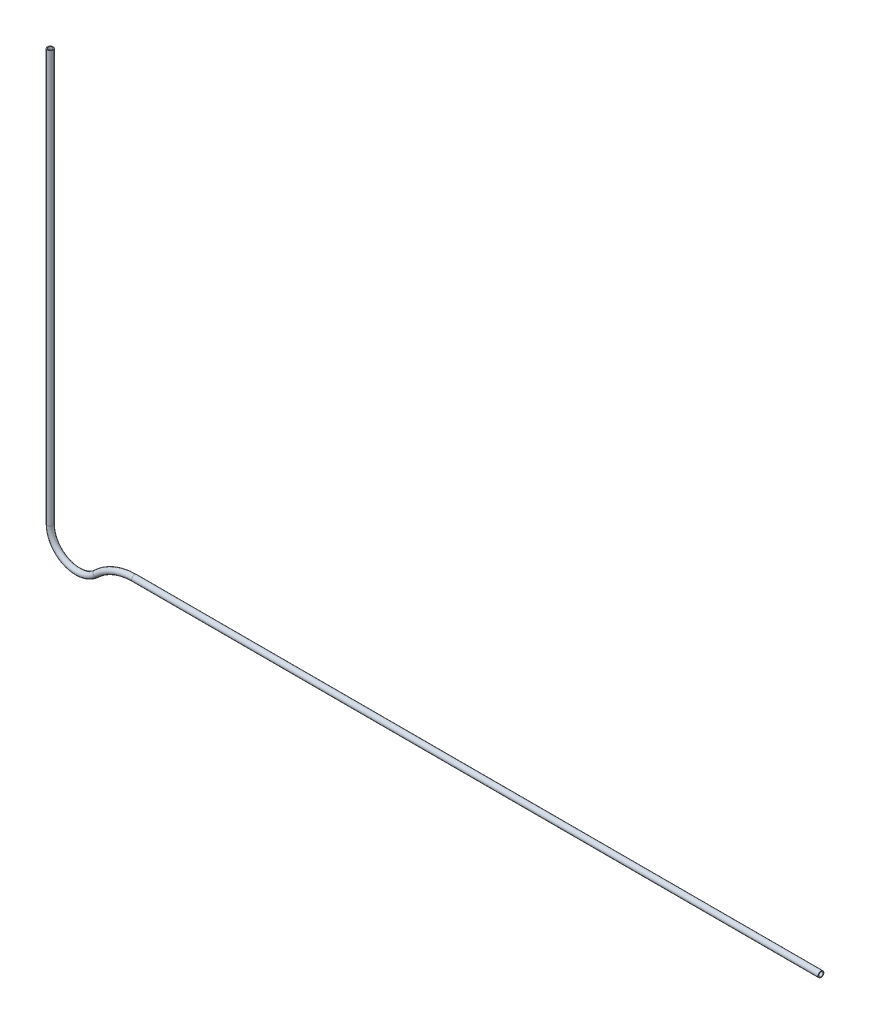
ISO-10303-21;
HEADER;
FILE_DESCRIPTION(('STEP AP214'),'2;1');
FILE_NAME('part.step','',(''),(''),'','','');
FILE_SCHEMA(('AUTOMOTIVE_DESIGN { 1 0 10303 214 1 1 1 1 }'));
ENDSEC;
DATA;
#1=APPLICATION_CONTEXT('core data for automotive mechanical design processes');
#2=APPLICATION_PROTOCOL_DEFINITION('international standard','automotive_design',2000,#1);
#3=PRODUCT_CONTEXT('',#1,'mechanical');
#4=PRODUCT('Part','Part','',(#3));
#5=PRODUCT_RELATED_PRODUCT_CATEGORY('part','',(#4));
#6=PRODUCT_DEFINITION_FORMATION('','',#4);
#7=PRODUCT_DEFINITION_CONTEXT('part definition',#1,'design');
#8=PRODUCT_DEFINITION('design','',#6,#7);
#9=PRODUCT_DEFINITION_SHAPE('','',#8);
#10=(LENGTH_UNIT() NAMED_UNIT(*) SI_UNIT(.MILLI.,.METRE.));
#11=(NAMED_UNIT(*) PLANE_ANGLE_UNIT() SI_UNIT($,.RADIAN.));
#12=(NAMED_UNIT(*) SI_UNIT($,.STERADIAN.) SOLID_ANGLE_UNIT());
#13=UNCERTAINTY_MEASURE_WITH_UNIT(LENGTH_MEASURE(1.E-05),#10,'distance_accuracy_value','');
#14=(GEOMETRIC_REPRESENTATION_CONTEXT(3) GLOBAL_UNCERTAINTY_ASSIGNED_CONTEXT((#13)) GLOBAL_UNIT_ASSIGNED_CONTEXT((#10,
#11,#12)) REPRESENTATION_CONTEXT('',''));
#15=CARTESIAN_POINT('',(0.,0.,0.));
#16=DIRECTION('',(0.,0.,1.));
#17=DIRECTION('',(1.,0.,0.));
#18=AXIS2_PLACEMENT_3D('',#15,#16,#17);
#19=CARTESIAN_POINT('',(-2806.98976363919,17.1525679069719,0.));
#20=DIRECTION('',(0.,1.,0.));
#21=DIRECTION('',(0.,0.,1.));
#22=AXIS2_PLACEMENT_3D('',#19,#20,#21);
#23=CYLINDRICAL_SURFACE('',#22,10.5);
#24=CARTESIAN_POINT('',(-2806.98976363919,17.1525679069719,0.));
#25=DIRECTION('',(0.,-1.,0.));
#26=DIRECTION('',(0.,0.,-1.));
#27=AXIS2_PLACEMENT_3D('',#24,#25,#26);
#28=CIRCLE('',#27,10.5);
#29=CARTESIAN_POINT('',(-2817.48976363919,17.1525679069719,0.));
#30=VERTEX_POINT('',#29);
#31=EDGE_CURVE('E35',#30,#30,#28,.T.);
#32=ORIENTED_EDGE('',*,*,#31,.F.);
#33=EDGE_LOOP('',(#32));
#34=FACE_BOUND('',#33,.T.);
#35=CARTESIAN_POINT('',(-2806.98976363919,1517.15256790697,0.));
#36=DIRECTION('',(0.,-1.,0.));
#37=DIRECTION('',(0.,0.,-1.));
#38=AXIS2_PLACEMENT_3D('',#35,#36,#37);
#39=CIRCLE('',#38,10.5);
#40=CARTESIAN_POINT('',(-2806.98976363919,1517.15256790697,-10.5));
#41=VERTEX_POINT('',#40);
#42=EDGE_CURVE('E10',#41,#41,#39,.T.);
#43=ORIENTED_EDGE('',*,*,#42,.T.);
#44=EDGE_LOOP('',(#43));
#45=FACE_BOUND('',#44,.T.);
#46=ADVANCED_FACE('F29',(#34,#45),#23,.T.);
#47=CARTESIAN_POINT('',(-2706.98976363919,17.1525679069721,0.));
#48=DIRECTION('',(0.,0.,-1.));
#49=DIRECTION('',(-1.,0.,0.));
#50=AXIS2_PLACEMENT_3D('',#47,#48,#49);
#51=TOROIDAL_SURFACE('',#50,100.,10.5);
#52=CARTESIAN_POINT('',(-2637.99317575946,-55.2316213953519,0.));
#53=DIRECTION('',(0.723841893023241,0.6899658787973,0.));
#54=DIRECTION('',(0.,0.,-1.));
#55=AXIS2_PLACEMENT_3D('',#52,#53,#54);
#56=CIRCLE('',#55,10.5);
#57=CARTESIAN_POINT('',(-2630.74853403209,-62.8319612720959,0.));
#58=VERTEX_POINT('',#57);
#59=EDGE_CURVE('E39',#58,#58,#56,.T.);
#60=CARTESIAN_POINT('',(-2706.98976363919,17.1525679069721,0.));
#61=DIRECTION('',(0.,0.,-1.));
#62=DIRECTION('',(-1.,0.,0.));
#63=AXIS2_PLACEMENT_3D('',#60,#61,#62);
#64=CIRCLE('',#63,110.5);
#65=EDGE_CURVE('',#58,#30,#64,.T.);
#66=ORIENTED_EDGE('',*,*,#59,.F.);
#67=ORIENTED_EDGE('',*,*,#31,.T.);
#68=ORIENTED_EDGE('',*,*,#65,.T.);
#69=ORIENTED_EDGE('',*,*,#65,.F.);
#70=EDGE_LOOP('',(#66,#68,#67,#69));
#71=FACE_BOUND('',#70,.T.);
#72=ADVANCED_FACE('F85',(#71),#51,.T.);
#73=CARTESIAN_POINT('',(-2500.,-200.,0.));
#74=DIRECTION('',(0.,0.,1.));
#75=DIRECTION('',(1.,0.,0.));
#76=AXIS2_PLACEMENT_3D('',#73,#74,#75);
#77=TOROIDAL_SURFACE('',#76,200.,10.5);
#78=CARTESIAN_POINT('',(-2500.,0.,0.));
#79=DIRECTION('',(1.,0.,0.));
#80=DIRECTION('',(0.,0.,-1.));
#81=AXIS2_PLACEMENT_3D('',#78,#79,#80);
#82=CIRCLE('',#81,10.5);
#83=CARTESIAN_POINT('',(-2500.,0.,-10.5));
#84=VERTEX_POINT('',#83);
#85=EDGE_CURVE('E43',#84,#84,#82,.T.);
#86=ORIENTED_EDGE('',*,*,#85,.F.);
#87=EDGE_LOOP('',(#86));
#88=FACE_BOUND('',#87,.T.);
#89=ORIENTED_EDGE('',*,*,#59,.T.);
#90=EDGE_LOOP('',(#89));
#91=FACE_BOUND('',#90,.T.);
#92=ADVANCED_FACE('F90',(#88,#91),#77,.T.);
#93=CARTESIAN_POINT('',(-2500.,0.,0.));
#94=DIRECTION('',(1.,0.,0.));
#95=DIRECTION('',(0.,1.,0.));
#96=AXIS2_PLACEMENT_3D('',#93,#94,#95);
#97=CYLINDRICAL_SURFACE('',#96,10.5);
#98=ORIENTED_EDGE('',*,*,#85,.T.);
#99=EDGE_LOOP('',(#98));
#100=FACE_BOUND('',#99,.T.);
#101=CARTESIAN_POINT('',(0.,0.,0.));
#102=DIRECTION('',(1.,0.,0.));
#103=DIRECTION('',(0.,0.,-1.));
#104=AXIS2_PLACEMENT_3D('',#101,#102,#103);
#105=CIRCLE('',#104,10.5);
#106=CARTESIAN_POINT('',(0.,0.,-10.5));
#107=VERTEX_POINT('',#106);
#108=EDGE_CURVE('E46',#107,#107,#105,.T.);
#109=ORIENTED_EDGE('',*,*,#108,.F.);
#110=EDGE_LOOP('',(#109));
#111=FACE_BOUND('',#110,.T.);
#112=ADVANCED_FACE('F95',(#100,#111),#97,.T.);
#113=CARTESIAN_POINT('',(-2806.98976363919,1517.15256790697,0.));
#114=DIRECTION('',(0.,-1.,0.));
#115=DIRECTION('',(0.,0.,-1.));
#116=AXIS2_PLACEMENT_3D('',#113,#114,#115);
#117=PLANE('',#116);
#118=CARTESIAN_POINT('',(-2806.98976363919,1517.15256790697,0.));
#119=DIRECTION('',(0.,-1.,0.));
#120=DIRECTION('',(1.,0.,0.));
#121=AXIS2_PLACEMENT_3D('',#118,#119,#120);
#122=CIRCLE('',#121,7.7);
#123=CARTESIAN_POINT('',(-2799.28976363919,1517.15256790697,0.));
#124=VERTEX_POINT('',#123);
#125=EDGE_CURVE('E49',#124,#124,#122,.T.);
#126=ORIENTED_EDGE('',*,*,#125,.T.);
#127=EDGE_LOOP('',(#126));
#128=FACE_BOUND('',#127,.T.);
#129=ORIENTED_EDGE('',*,*,#42,.F.);
#130=EDGE_LOOP('',(#129));
#131=FACE_BOUND('',#130,.T.);
#132=ADVANCED_FACE('F102',(#128,#131),#117,.F.);
#133=CARTESIAN_POINT('',(0.,0.,0.));
#134=DIRECTION('',(1.,0.,0.));
#135=DIRECTION('',(0.,0.,-1.));
#136=AXIS2_PLACEMENT_3D('',#133,#134,#135);
#137=PLANE('',#136);
#138=CARTESIAN_POINT('',(0.,0.,0.));
#139=DIRECTION('',(1.,0.,0.));
#140=DIRECTION('',(0.,0.,-1.));
#141=AXIS2_PLACEMENT_3D('',#138,#139,#140);
#142=CIRCLE('',#141,7.7);
#143=CARTESIAN_POINT('',(0.,0.,-7.7));
#144=VERTEX_POINT('',#143);
#145=EDGE_CURVE('E52',#144,#144,#142,.T.);
#146=ORIENTED_EDGE('',*,*,#145,.F.);
#147=EDGE_LOOP('',(#146));
#148=FACE_BOUND('',#147,.T.);
#149=ORIENTED_EDGE('',*,*,#108,.T.);
#150=EDGE_LOOP('',(#149));
#151=FACE_BOUND('',#150,.T.);
#152=ADVANCED_FACE('F82',(#148,#151),#137,.T.);
#153=CARTESIAN_POINT('',(-2806.98976363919,17.1525679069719,0.));
#154=DIRECTION('',(0.,1.,0.));
#155=DIRECTION('',(0.,0.,1.));
#156=AXIS2_PLACEMENT_3D('',#153,#154,#155);
#157=CYLINDRICAL_SURFACE('',#156,7.7);
#158=CARTESIAN_POINT('',(-2806.98976363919,17.152567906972,0.));
#159=DIRECTION('',(0.,-1.,0.));
#160=DIRECTION('',(1.,0.,0.));
#161=AXIS2_PLACEMENT_3D('',#158,#159,#160);
#162=CIRCLE('',#161,7.7);
#163=CARTESIAN_POINT('',(-2814.68976363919,17.152567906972,0.));
#164=VERTEX_POINT('',#163);
#165=EDGE_CURVE('E58',#164,#164,#162,.T.);
#166=ORIENTED_EDGE('',*,*,#165,.T.);
#167=EDGE_LOOP('',(#166));
#168=FACE_BOUND('',#167,.T.);
#169=ORIENTED_EDGE('',*,*,#125,.F.);
#170=EDGE_LOOP('',(#169));
#171=FACE_BOUND('',#170,.T.);
#172=ADVANCED_FACE('F67',(#168,#171),#157,.F.);
#173=CARTESIAN_POINT('',(-2706.98976363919,17.1525679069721,0.));
#174=DIRECTION('',(0.,0.,-1.));
#175=DIRECTION('',(-1.,0.,0.));
#176=AXIS2_PLACEMENT_3D('',#173,#174,#175);
#177=TOROIDAL_SURFACE('',#176,100.,7.7);
#178=CARTESIAN_POINT('',(-2637.99317575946,-55.2316213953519,0.));
#179=DIRECTION('',(0.723841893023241,0.689965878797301,0.));
#180=DIRECTION('',(-0.689965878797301,0.723841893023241,0.));
#181=AXIS2_PLACEMENT_3D('',#178,#179,#180);
#182=CIRCLE('',#181,7.7);
#183=CARTESIAN_POINT('',(-2632.68043849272,-60.8052039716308,0.));
#184=VERTEX_POINT('',#183);
#185=EDGE_CURVE('E61',#184,#184,#182,.T.);
#186=CARTESIAN_POINT('',(-2706.98976363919,17.1525679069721,0.));
#187=DIRECTION('',(0.,0.,-1.));
#188=DIRECTION('',(-1.,0.,0.));
#189=AXIS2_PLACEMENT_3D('',#186,#187,#188);
#190=CIRCLE('',#189,107.7);
#191=EDGE_CURVE('',#184,#164,#190,.T.);
#192=ORIENTED_EDGE('',*,*,#185,.T.);
#193=ORIENTED_EDGE('',*,*,#165,.F.);
#194=ORIENTED_EDGE('',*,*,#191,.T.);
#195=ORIENTED_EDGE('',*,*,#191,.F.);
#196=EDGE_LOOP('',(#192,#194,#193,#195));
#197=FACE_BOUND('',#196,.T.);
#198=ADVANCED_FACE('F70',(#197),#177,.F.);
#199=CARTESIAN_POINT('',(-2500.,-200.,0.));
#200=DIRECTION('',(0.,0.,1.));
#201=DIRECTION('',(1.,0.,0.));
#202=AXIS2_PLACEMENT_3D('',#199,#200,#201);
#203=TOROIDAL_SURFACE('',#202,200.,7.7);
#204=CARTESIAN_POINT('',(-2500.,0.,0.));
#205=DIRECTION('',(1.,0.,0.));
#206=DIRECTION('',(0.,1.,0.));
#207=AXIS2_PLACEMENT_3D('',#204,#205,#206);
#208=CIRCLE('',#207,7.7);
#209=CARTESIAN_POINT('',(-2500.,7.69999999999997,0.));
#210=VERTEX_POINT('',#209);
#211=EDGE_CURVE('E55',#210,#210,#208,.T.);
#212=ORIENTED_EDGE('',*,*,#211,.T.);
#213=EDGE_LOOP('',(#212));
#214=FACE_BOUND('',#213,.T.);
#215=ORIENTED_EDGE('',*,*,#185,.F.);
#216=EDGE_LOOP('',(#215));
#217=FACE_BOUND('',#216,.T.);
#218=ADVANCED_FACE('F72',(#214,#217),#203,.F.);
#219=CARTESIAN_POINT('',(-2500.,0.,0.));
#220=DIRECTION('',(1.,0.,0.));
#221=DIRECTION('',(0.,1.,0.));
#222=AXIS2_PLACEMENT_3D('',#219,#220,#221);
#223=CYLINDRICAL_SURFACE('',#222,7.7);
#224=ORIENTED_EDGE('',*,*,#211,.F.);
#225=EDGE_LOOP('',(#224));
#226=FACE_BOUND('',#225,.T.);
#227=ORIENTED_EDGE('',*,*,#145,.T.);
#228=EDGE_LOOP('',(#227));
#229=FACE_BOUND('',#228,.T.);
#230=ADVANCED_FACE('F79',(#226,#229),#223,.F.);
#231=CLOSED_SHELL('',(#46,#72,#92,#112,#132,#152,#172,#198,#218,#230));
#232=MANIFOLD_SOLID_BREP('B2',#231);
#233=ADVANCED_BREP_SHAPE_REPRESENTATION('',(#18,#232),#14);
#234=SHAPE_DEFINITION_REPRESENTATION(#9,#233);
ENDSEC;
END-ISO-10303-21;
